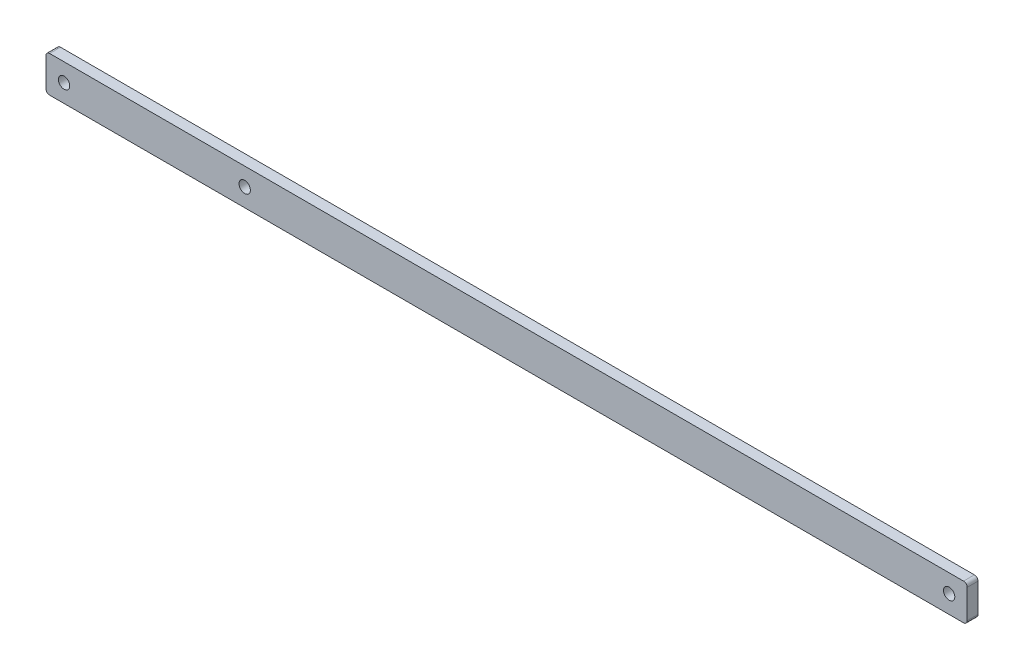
ISO-10303-21;
HEADER;
FILE_DESCRIPTION(('STEP AP214'),'2;1');
FILE_NAME('part.step','',(''),(''),'','','');
FILE_SCHEMA(('AUTOMOTIVE_DESIGN { 1 0 10303 214 1 1 1 1 }'));
ENDSEC;
DATA;
#1=APPLICATION_CONTEXT('core data for automotive mechanical design processes');
#2=APPLICATION_PROTOCOL_DEFINITION('international standard','automotive_design',2000,#1);
#3=PRODUCT_CONTEXT('',#1,'mechanical');
#4=PRODUCT('Part','Part','',(#3));
#5=PRODUCT_RELATED_PRODUCT_CATEGORY('part','',(#4));
#6=PRODUCT_DEFINITION_FORMATION('','',#4);
#7=PRODUCT_DEFINITION_CONTEXT('part definition',#1,'design');
#8=PRODUCT_DEFINITION('design','',#6,#7);
#9=PRODUCT_DEFINITION_SHAPE('','',#8);
#10=(LENGTH_UNIT() NAMED_UNIT(*) SI_UNIT(.MILLI.,.METRE.));
#11=(NAMED_UNIT(*) PLANE_ANGLE_UNIT() SI_UNIT($,.RADIAN.));
#12=(NAMED_UNIT(*) SI_UNIT($,.STERADIAN.) SOLID_ANGLE_UNIT());
#13=UNCERTAINTY_MEASURE_WITH_UNIT(LENGTH_MEASURE(1.E-05),#10,'distance_accuracy_value','');
#14=(GEOMETRIC_REPRESENTATION_CONTEXT(3) GLOBAL_UNCERTAINTY_ASSIGNED_CONTEXT((#13)) GLOBAL_UNIT_ASSIGNED_CONTEXT((#10,
#11,#12)) REPRESENTATION_CONTEXT('',''));
#15=CARTESIAN_POINT('',(0.,0.,0.));
#16=DIRECTION('',(0.,0.,1.));
#17=DIRECTION('',(1.,0.,0.));
#18=AXIS2_PLACEMENT_3D('',#15,#16,#17);
#19=CARTESIAN_POINT('',(0.,0.,7.62));
#20=DIRECTION('',(1.,0.,0.));
#21=DIRECTION('',(0.,0.,-1.));
#22=AXIS2_PLACEMENT_3D('',#19,#20,#21);
#23=PLANE('',#22);
#24=DIRECTION('',(0.,-1.,0.));
#25=VECTOR('',#24,1.);
#26=CARTESIAN_POINT('',(0.,0.,7.62));
#27=LINE('',#26,#25);
#28=CARTESIAN_POINT('',(0.,22.86,7.62));
#29=VERTEX_POINT('',#28);
#30=CARTESIAN_POINT('',(0.,2.54,7.62));
#31=VERTEX_POINT('',#30);
#32=EDGE_CURVE('E129',#29,#31,#27,.T.);
#33=ORIENTED_EDGE('',*,*,#32,.F.);
#34=DIRECTION('',(0.,0.,-1.));
#35=VECTOR('',#34,1.);
#36=CARTESIAN_POINT('',(0.,22.86,7.62));
#37=LINE('',#36,#35);
#38=CARTESIAN_POINT('',(0.,22.86,0.));
#39=VERTEX_POINT('',#38);
#40=EDGE_CURVE('E113',#29,#39,#37,.T.);
#41=ORIENTED_EDGE('',*,*,#40,.T.);
#42=DIRECTION('',(0.,-1.,0.));
#43=VECTOR('',#42,1.);
#44=CARTESIAN_POINT('',(0.,0.,0.));
#45=LINE('',#44,#43);
#46=CARTESIAN_POINT('',(0.,2.54,0.));
#47=VERTEX_POINT('',#46);
#48=EDGE_CURVE('E126',#39,#47,#45,.T.);
#49=ORIENTED_EDGE('',*,*,#48,.T.);
#50=DIRECTION('',(0.,0.,-1.));
#51=VECTOR('',#50,1.);
#52=CARTESIAN_POINT('',(0.,2.54,7.62));
#53=LINE('',#52,#51);
#54=EDGE_CURVE('E132',#47,#31,#53,.F.);
#55=ORIENTED_EDGE('',*,*,#54,.T.);
#56=EDGE_LOOP('',(#33,#41,#49,#55));
#57=FACE_BOUND('',#56,.T.);
#58=ADVANCED_FACE('F42',(#57),#23,.F.);
#59=CARTESIAN_POINT('',(0.,0.,7.62));
#60=DIRECTION('',(0.,1.,0.));
#61=DIRECTION('',(0.,0.,1.));
#62=AXIS2_PLACEMENT_3D('',#59,#60,#61);
#63=PLANE('',#62);
#64=DIRECTION('',(1.,0.,0.));
#65=VECTOR('',#64,1.);
#66=CARTESIAN_POINT('',(0.,0.,7.62));
#67=LINE('',#66,#65);
#68=CARTESIAN_POINT('',(2.54,0.,7.62));
#69=VERTEX_POINT('',#68);
#70=CARTESIAN_POINT('',(645.16,0.,7.62));
#71=VERTEX_POINT('',#70);
#72=EDGE_CURVE('E194',#69,#71,#67,.T.);
#73=ORIENTED_EDGE('',*,*,#72,.F.);
#74=DIRECTION('',(0.,0.,-1.));
#75=VECTOR('',#74,1.);
#76=CARTESIAN_POINT('',(2.54,0.,7.62));
#77=LINE('',#76,#75);
#78=CARTESIAN_POINT('',(2.54,0.,0.));
#79=VERTEX_POINT('',#78);
#80=EDGE_CURVE('E185',#69,#79,#77,.T.);
#81=ORIENTED_EDGE('',*,*,#80,.T.);
#82=DIRECTION('',(1.,0.,0.));
#83=VECTOR('',#82,1.);
#84=CARTESIAN_POINT('',(0.,0.,0.));
#85=LINE('',#84,#83);
#86=CARTESIAN_POINT('',(645.16,0.,0.));
#87=VERTEX_POINT('',#86);
#88=EDGE_CURVE('E137',#79,#87,#85,.T.);
#89=ORIENTED_EDGE('',*,*,#88,.T.);
#90=DIRECTION('',(0.,0.,-1.));
#91=VECTOR('',#90,1.);
#92=CARTESIAN_POINT('',(645.16,0.,7.62));
#93=LINE('',#92,#91);
#94=EDGE_CURVE('E182',#87,#71,#93,.F.);
#95=ORIENTED_EDGE('',*,*,#94,.T.);
#96=EDGE_LOOP('',(#73,#81,#89,#95));
#97=FACE_BOUND('',#96,.T.);
#98=ADVANCED_FACE('F249',(#97),#63,.F.);
#99=CARTESIAN_POINT('',(647.7,0.,7.62));
#100=DIRECTION('',(-1.,0.,0.));
#101=DIRECTION('',(0.,0.,1.));
#102=AXIS2_PLACEMENT_3D('',#99,#100,#101);
#103=PLANE('',#102);
#104=DIRECTION('',(0.,1.,0.));
#105=VECTOR('',#104,1.);
#106=CARTESIAN_POINT('',(647.7,0.,7.62));
#107=LINE('',#106,#105);
#108=CARTESIAN_POINT('',(647.7,2.54,7.62));
#109=VERTEX_POINT('',#108);
#110=CARTESIAN_POINT('',(647.7,22.86,7.62));
#111=VERTEX_POINT('',#110);
#112=EDGE_CURVE('E192',#109,#111,#107,.T.);
#113=ORIENTED_EDGE('',*,*,#112,.F.);
#114=DIRECTION('',(0.,0.,-1.));
#115=VECTOR('',#114,1.);
#116=CARTESIAN_POINT('',(647.7,2.54,7.62));
#117=LINE('',#116,#115);
#118=CARTESIAN_POINT('',(647.7,2.54,0.));
#119=VERTEX_POINT('',#118);
#120=EDGE_CURVE('E11',#109,#119,#117,.T.);
#121=ORIENTED_EDGE('',*,*,#120,.T.);
#122=DIRECTION('',(0.,1.,0.));
#123=VECTOR('',#122,1.);
#124=CARTESIAN_POINT('',(647.7,0.,0.));
#125=LINE('',#124,#123);
#126=CARTESIAN_POINT('',(647.7,22.86,0.));
#127=VERTEX_POINT('',#126);
#128=EDGE_CURVE('E143',#119,#127,#125,.T.);
#129=ORIENTED_EDGE('',*,*,#128,.T.);
#130=DIRECTION('',(0.,0.,-1.));
#131=VECTOR('',#130,1.);
#132=CARTESIAN_POINT('',(647.7,22.86,7.62));
#133=LINE('',#132,#131);
#134=EDGE_CURVE('E51',#127,#111,#133,.F.);
#135=ORIENTED_EDGE('',*,*,#134,.T.);
#136=EDGE_LOOP('',(#113,#121,#129,#135));
#137=FACE_BOUND('',#136,.T.);
#138=ADVANCED_FACE('F242',(#137),#103,.F.);
#139=CARTESIAN_POINT('',(0.,25.4,7.62));
#140=DIRECTION('',(0.,-1.,0.));
#141=DIRECTION('',(0.,0.,-1.));
#142=AXIS2_PLACEMENT_3D('',#139,#140,#141);
#143=PLANE('',#142);
#144=DIRECTION('',(-1.,0.,0.));
#145=VECTOR('',#144,1.);
#146=CARTESIAN_POINT('',(0.,25.4,0.));
#147=LINE('',#146,#145);
#148=CARTESIAN_POINT('',(645.16,25.4,0.));
#149=VERTEX_POINT('',#148);
#150=CARTESIAN_POINT('',(2.54,25.4,0.));
#151=VERTEX_POINT('',#150);
#152=EDGE_CURVE('E154',#149,#151,#147,.T.);
#153=ORIENTED_EDGE('',*,*,#152,.T.);
#154=DIRECTION('',(0.,0.,-1.));
#155=VECTOR('',#154,1.);
#156=CARTESIAN_POINT('',(2.54,25.4,7.62));
#157=LINE('',#156,#155);
#158=CARTESIAN_POINT('',(2.54,25.4,7.62));
#159=VERTEX_POINT('',#158);
#160=EDGE_CURVE('E114',#151,#159,#157,.F.);
#161=ORIENTED_EDGE('',*,*,#160,.T.);
#162=DIRECTION('',(-1.,0.,0.));
#163=VECTOR('',#162,1.);
#164=CARTESIAN_POINT('',(0.,25.4,7.62));
#165=LINE('',#164,#163);
#166=CARTESIAN_POINT('',(645.16,25.4,7.62));
#167=VERTEX_POINT('',#166);
#168=EDGE_CURVE('E149',#167,#159,#165,.T.);
#169=ORIENTED_EDGE('',*,*,#168,.F.);
#170=DIRECTION('',(0.,0.,-1.));
#171=VECTOR('',#170,1.);
#172=CARTESIAN_POINT('',(645.16,25.4,7.62));
#173=LINE('',#172,#171);
#174=EDGE_CURVE('E120',#167,#149,#173,.T.);
#175=ORIENTED_EDGE('',*,*,#174,.T.);
#176=EDGE_LOOP('',(#153,#161,#169,#175));
#177=FACE_BOUND('',#176,.T.);
#178=ADVANCED_FACE('F231',(#177),#143,.F.);
#179=CARTESIAN_POINT('',(0.,0.,7.62));
#180=DIRECTION('',(0.,0.,-1.));
#181=DIRECTION('',(-1.,0.,0.));
#182=AXIS2_PLACEMENT_3D('',#179,#180,#181);
#183=PLANE('',#182);
#184=CARTESIAN_POINT('',(139.7,12.7,7.62));
#185=DIRECTION('',(0.,0.,1.));
#186=DIRECTION('',(1.,0.,0.));
#187=AXIS2_PLACEMENT_3D('',#184,#185,#186);
#188=CIRCLE('',#187,3.99999999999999);
#189=CARTESIAN_POINT('',(143.7,12.7,7.62));
#190=VERTEX_POINT('',#189);
#191=EDGE_CURVE('E212',#190,#190,#188,.T.);
#192=ORIENTED_EDGE('',*,*,#191,.F.);
#193=EDGE_LOOP('',(#192));
#194=FACE_BOUND('',#193,.T.);
#195=CARTESIAN_POINT('',(635.,12.6999999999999,7.62));
#196=DIRECTION('',(0.,0.,-1.));
#197=DIRECTION('',(-1.,0.,0.));
#198=AXIS2_PLACEMENT_3D('',#195,#196,#197);
#199=CIRCLE('',#198,4.);
#200=CARTESIAN_POINT('',(639.,12.6999999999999,7.62));
#201=VERTEX_POINT('',#200);
#202=EDGE_CURVE('E204',#201,#201,#199,.T.);
#203=ORIENTED_EDGE('',*,*,#202,.T.);
#204=EDGE_LOOP('',(#203));
#205=FACE_BOUND('',#204,.T.);
#206=CARTESIAN_POINT('',(12.7,12.6999999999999,7.62));
#207=DIRECTION('',(0.,0.,1.));
#208=DIRECTION('',(1.,0.,0.));
#209=AXIS2_PLACEMENT_3D('',#206,#207,#208);
#210=CIRCLE('',#209,4.);
#211=CARTESIAN_POINT('',(16.7,12.6999999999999,7.62));
#212=VERTEX_POINT('',#211);
#213=EDGE_CURVE('E146',#212,#212,#210,.T.);
#214=ORIENTED_EDGE('',*,*,#213,.F.);
#215=EDGE_LOOP('',(#214));
#216=FACE_BOUND('',#215,.T.);
#217=ORIENTED_EDGE('',*,*,#168,.T.);
#218=CARTESIAN_POINT('',(2.54,22.86,7.62));
#219=DIRECTION('',(0.,0.,-1.));
#220=DIRECTION('',(-1.,0.,0.));
#221=AXIS2_PLACEMENT_3D('',#218,#219,#220);
#222=CIRCLE('',#221,2.54);
#223=EDGE_CURVE('E179',#159,#29,#222,.F.);
#224=ORIENTED_EDGE('',*,*,#223,.T.);
#225=ORIENTED_EDGE('',*,*,#32,.T.);
#226=CARTESIAN_POINT('',(2.54,2.54,7.62));
#227=DIRECTION('',(0.,0.,-1.));
#228=DIRECTION('',(-1.,0.,0.));
#229=AXIS2_PLACEMENT_3D('',#226,#227,#228);
#230=CIRCLE('',#229,2.54);
#231=EDGE_CURVE('E176',#31,#69,#230,.F.);
#232=ORIENTED_EDGE('',*,*,#231,.T.);
#233=ORIENTED_EDGE('',*,*,#72,.T.);
#234=CARTESIAN_POINT('',(645.16,2.54,7.62));
#235=DIRECTION('',(0.,0.,-1.));
#236=DIRECTION('',(-1.,0.,0.));
#237=AXIS2_PLACEMENT_3D('',#234,#235,#236);
#238=CIRCLE('',#237,2.54);
#239=EDGE_CURVE('E64',#71,#109,#238,.F.);
#240=ORIENTED_EDGE('',*,*,#239,.T.);
#241=ORIENTED_EDGE('',*,*,#112,.T.);
#242=CARTESIAN_POINT('',(645.16,22.86,7.62));
#243=DIRECTION('',(0.,0.,-1.));
#244=DIRECTION('',(-1.,0.,0.));
#245=AXIS2_PLACEMENT_3D('',#242,#243,#244);
#246=CIRCLE('',#245,2.54);
#247=EDGE_CURVE('E171',#111,#167,#246,.F.);
#248=ORIENTED_EDGE('',*,*,#247,.T.);
#249=EDGE_LOOP('',(#217,#224,#225,#232,#233,#240,#241,#248));
#250=FACE_BOUND('',#249,.T.);
#251=ADVANCED_FACE('F228',(#194,#205,#216,#250),#183,.F.);
#252=CARTESIAN_POINT('',(0.,0.,0.));
#253=DIRECTION('',(0.,0.,-1.));
#254=DIRECTION('',(-1.,0.,0.));
#255=AXIS2_PLACEMENT_3D('',#252,#253,#254);
#256=PLANE('',#255);
#257=CARTESIAN_POINT('',(139.7,12.7,0.));
#258=DIRECTION('',(0.,0.,1.));
#259=DIRECTION('',(1.,0.,0.));
#260=AXIS2_PLACEMENT_3D('',#257,#258,#259);
#261=CIRCLE('',#260,3.99999999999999);
#262=CARTESIAN_POINT('',(143.7,12.7,0.));
#263=VERTEX_POINT('',#262);
#264=EDGE_CURVE('E208',#263,#263,#261,.T.);
#265=ORIENTED_EDGE('',*,*,#264,.T.);
#266=EDGE_LOOP('',(#265));
#267=FACE_BOUND('',#266,.T.);
#268=CARTESIAN_POINT('',(635.,12.6999999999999,0.));
#269=DIRECTION('',(0.,0.,-1.));
#270=DIRECTION('',(-1.,0.,0.));
#271=AXIS2_PLACEMENT_3D('',#268,#269,#270);
#272=CIRCLE('',#271,4.);
#273=CARTESIAN_POINT('',(639.,12.6999999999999,0.));
#274=VERTEX_POINT('',#273);
#275=EDGE_CURVE('E202',#274,#274,#272,.T.);
#276=ORIENTED_EDGE('',*,*,#275,.F.);
#277=EDGE_LOOP('',(#276));
#278=FACE_BOUND('',#277,.T.);
#279=CARTESIAN_POINT('',(12.7,12.6999999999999,0.));
#280=DIRECTION('',(0.,0.,1.));
#281=DIRECTION('',(1.,0.,0.));
#282=AXIS2_PLACEMENT_3D('',#279,#280,#281);
#283=CIRCLE('',#282,4.);
#284=CARTESIAN_POINT('',(16.7,12.6999999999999,0.));
#285=VERTEX_POINT('',#284);
#286=EDGE_CURVE('E138',#285,#285,#283,.T.);
#287=ORIENTED_EDGE('',*,*,#286,.T.);
#288=EDGE_LOOP('',(#287));
#289=FACE_BOUND('',#288,.T.);
#290=ORIENTED_EDGE('',*,*,#48,.F.);
#291=CARTESIAN_POINT('',(2.54,22.86,0.));
#292=DIRECTION('',(0.,0.,-1.));
#293=DIRECTION('',(-1.,0.,0.));
#294=AXIS2_PLACEMENT_3D('',#291,#292,#293);
#295=CIRCLE('',#294,2.54);
#296=EDGE_CURVE('E109',#39,#151,#295,.T.);
#297=ORIENTED_EDGE('',*,*,#296,.T.);
#298=ORIENTED_EDGE('',*,*,#152,.F.);
#299=CARTESIAN_POINT('',(645.16,22.86,0.));
#300=DIRECTION('',(0.,0.,-1.));
#301=DIRECTION('',(-1.,0.,0.));
#302=AXIS2_PLACEMENT_3D('',#299,#300,#301);
#303=CIRCLE('',#302,2.54);
#304=EDGE_CURVE('E131',#149,#127,#303,.T.);
#305=ORIENTED_EDGE('',*,*,#304,.T.);
#306=ORIENTED_EDGE('',*,*,#128,.F.);
#307=CARTESIAN_POINT('',(645.16,2.54,0.));
#308=DIRECTION('',(0.,0.,-1.));
#309=DIRECTION('',(-1.,0.,0.));
#310=AXIS2_PLACEMENT_3D('',#307,#308,#309);
#311=CIRCLE('',#310,2.54);
#312=EDGE_CURVE('E161',#119,#87,#311,.T.);
#313=ORIENTED_EDGE('',*,*,#312,.T.);
#314=ORIENTED_EDGE('',*,*,#88,.F.);
#315=CARTESIAN_POINT('',(2.54,2.54,0.));
#316=DIRECTION('',(0.,0.,-1.));
#317=DIRECTION('',(-1.,0.,0.));
#318=AXIS2_PLACEMENT_3D('',#315,#316,#317);
#319=CIRCLE('',#318,2.54);
#320=EDGE_CURVE('E121',#79,#47,#319,.T.);
#321=ORIENTED_EDGE('',*,*,#320,.T.);
#322=EDGE_LOOP('',(#290,#297,#298,#305,#306,#313,#314,#321));
#323=FACE_BOUND('',#322,.T.);
#324=ADVANCED_FACE('F134',(#267,#278,#289,#323),#256,.T.);
#325=CARTESIAN_POINT('',(12.7,12.6999999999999,0.));
#326=DIRECTION('',(0.,0.,1.));
#327=DIRECTION('',(1.,0.,0.));
#328=AXIS2_PLACEMENT_3D('',#325,#326,#327);
#329=CYLINDRICAL_SURFACE('',#328,4.);
#330=CARTESIAN_POINT('',(16.7,12.6999999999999,0.));
#331=CARTESIAN_POINT('',(16.7,12.6999999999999,0.0793749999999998));
#332=CARTESIAN_POINT('',(16.7,12.6999999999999,0.15875));
#333=CARTESIAN_POINT('',(16.7,12.6999999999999,0.3175));
#334=CARTESIAN_POINT('',(16.7,12.6999999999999,0.396875));
#335=CARTESIAN_POINT('',(16.7,12.6999999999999,0.555625));
#336=CARTESIAN_POINT('',(16.7,12.6999999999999,0.635));
#337=CARTESIAN_POINT('',(16.7,12.6999999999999,0.79375));
#338=CARTESIAN_POINT('',(16.7,12.6999999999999,0.873125));
#339=CARTESIAN_POINT('',(16.7,12.6999999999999,1.031875));
#340=CARTESIAN_POINT('',(16.7,12.6999999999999,1.11125));
#341=CARTESIAN_POINT('',(16.7,12.6999999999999,1.27));
#342=CARTESIAN_POINT('',(16.7,12.6999999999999,1.349375));
#343=CARTESIAN_POINT('',(16.7,12.6999999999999,1.508125));
#344=CARTESIAN_POINT('',(16.7,12.6999999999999,1.5875));
#345=CARTESIAN_POINT('',(16.7,12.6999999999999,1.74625));
#346=CARTESIAN_POINT('',(16.7,12.6999999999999,1.825625));
#347=CARTESIAN_POINT('',(16.7,12.6999999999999,1.984375));
#348=CARTESIAN_POINT('',(16.7,12.6999999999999,2.06375));
#349=CARTESIAN_POINT('',(16.7,12.6999999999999,2.2225));
#350=CARTESIAN_POINT('',(16.7,12.6999999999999,2.301875));
#351=CARTESIAN_POINT('',(16.7,12.6999999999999,2.460625));
#352=CARTESIAN_POINT('',(16.7,12.6999999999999,2.54));
#353=CARTESIAN_POINT('',(16.7,12.6999999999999,2.69875));
#354=CARTESIAN_POINT('',(16.7,12.6999999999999,2.778125));
#355=CARTESIAN_POINT('',(16.7,12.6999999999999,2.936875));
#356=CARTESIAN_POINT('',(16.7,12.6999999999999,3.01625));
#357=CARTESIAN_POINT('',(16.7,12.6999999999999,3.175));
#358=CARTESIAN_POINT('',(16.7,12.6999999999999,3.254375));
#359=CARTESIAN_POINT('',(16.7,12.6999999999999,3.413125));
#360=CARTESIAN_POINT('',(16.7,12.6999999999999,3.4925));
#361=CARTESIAN_POINT('',(16.7,12.6999999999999,3.65125));
#362=CARTESIAN_POINT('',(16.7,12.6999999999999,3.730625));
#363=CARTESIAN_POINT('',(16.7,12.6999999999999,3.889375));
#364=CARTESIAN_POINT('',(16.7,12.6999999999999,3.96875));
#365=CARTESIAN_POINT('',(16.7,12.6999999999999,4.1275));
#366=CARTESIAN_POINT('',(16.7,12.6999999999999,4.206875));
#367=CARTESIAN_POINT('',(16.7,12.6999999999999,4.365625));
#368=CARTESIAN_POINT('',(16.7,12.6999999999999,4.445));
#369=CARTESIAN_POINT('',(16.7,12.6999999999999,4.60375));
#370=CARTESIAN_POINT('',(16.7,12.6999999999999,4.683125));
#371=CARTESIAN_POINT('',(16.7,12.6999999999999,4.841875));
#372=CARTESIAN_POINT('',(16.7,12.6999999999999,4.92125));
#373=CARTESIAN_POINT('',(16.7,12.6999999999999,5.08));
#374=CARTESIAN_POINT('',(16.7,12.6999999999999,5.159375));
#375=CARTESIAN_POINT('',(16.7,12.6999999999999,5.318125));
#376=CARTESIAN_POINT('',(16.7,12.6999999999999,5.3975));
#377=CARTESIAN_POINT('',(16.7,12.6999999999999,5.55625));
#378=CARTESIAN_POINT('',(16.7,12.6999999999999,5.635625));
#379=CARTESIAN_POINT('',(16.7,12.6999999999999,5.794375));
#380=CARTESIAN_POINT('',(16.7,12.6999999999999,5.87375));
#381=CARTESIAN_POINT('',(16.7,12.6999999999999,6.0325));
#382=CARTESIAN_POINT('',(16.7,12.6999999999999,6.111875));
#383=CARTESIAN_POINT('',(16.7,12.6999999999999,6.270625));
#384=CARTESIAN_POINT('',(16.7,12.6999999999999,6.35));
#385=CARTESIAN_POINT('',(16.7,12.6999999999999,6.50875));
#386=CARTESIAN_POINT('',(16.7,12.6999999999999,6.588125));
#387=CARTESIAN_POINT('',(16.7,12.6999999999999,6.746875));
#388=CARTESIAN_POINT('',(16.7,12.6999999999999,6.82625));
#389=CARTESIAN_POINT('',(16.7,12.6999999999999,6.985));
#390=CARTESIAN_POINT('',(16.7,12.6999999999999,7.064375));
#391=CARTESIAN_POINT('',(16.7,12.6999999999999,7.223125));
#392=CARTESIAN_POINT('',(16.7,12.6999999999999,7.3025));
#393=CARTESIAN_POINT('',(16.7,12.6999999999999,7.46125));
#394=CARTESIAN_POINT('',(16.7,12.6999999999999,7.540625));
#395=CARTESIAN_POINT('',(16.7,12.6999999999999,7.62));
#396=B_SPLINE_CURVE_WITH_KNOTS('',3,(#330,#331,#332,#333,#334,#335,#336,#337,#338,#339,#340,
#341,#342,#343,#344,#345,#346,#347,#348,#349,#350,#351,#352,#353,#354,#355,#356,#357,#358,#359,
#360,#361,#362,#363,#364,#365,#366,#367,#368,#369,#370,#371,#372,#373,#374,#375,#376,#377,#378,
#379,#380,#381,#382,#383,#384,#385,#386,#387,#388,#389,#390,#391,#392,#393,#394,#395),
.UNSPECIFIED.,.F.,.F.,(4,2,2,2,2,2,2,2,2,2,2,2,2,2,2,2,2,2,2,2,2,2,2,2,2,2,2,2,2,2,2,2,4),(0.,
0.238125,0.47625,0.714375,0.9525,1.190625,1.42875,1.666875,1.905,2.143125,2.38125,2.619375,
2.8575,3.095625,3.33375,3.571875,3.81,4.048125,4.28625,4.524375,4.7625,5.000625,5.23875,
5.476875,5.715,5.953125,6.19125,6.429375,6.6675,6.905625,7.14375,7.381875,7.62),.UNSPECIFIED.);
#397=EDGE_CURVE('BSEAM273',#285,#212,#396,.T.);
#398=ORIENTED_EDGE('',*,*,#286,.F.);
#399=ORIENTED_EDGE('',*,*,#213,.T.);
#400=ORIENTED_EDGE('',*,*,#397,.T.);
#401=ORIENTED_EDGE('',*,*,#397,.F.);
#402=EDGE_LOOP('',(#398,#400,#399,#401));
#403=FACE_BOUND('',#402,.T.);
#404=ADVANCED_FACE('F273',(#403),#329,.F.);
#405=CARTESIAN_POINT('',(635.,12.6999999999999,0.));
#406=DIRECTION('',(0.,0.,1.));
#407=DIRECTION('',(1.,0.,0.));
#408=AXIS2_PLACEMENT_3D('',#405,#406,#407);
#409=CYLINDRICAL_SURFACE('',#408,4.);
#410=CARTESIAN_POINT('',(639.,12.6999999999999,0.));
#411=CARTESIAN_POINT('',(639.,12.6999999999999,0.0793749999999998));
#412=CARTESIAN_POINT('',(639.,12.6999999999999,0.15875));
#413=CARTESIAN_POINT('',(639.,12.6999999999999,0.3175));
#414=CARTESIAN_POINT('',(639.,12.6999999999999,0.396875));
#415=CARTESIAN_POINT('',(639.,12.6999999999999,0.555625));
#416=CARTESIAN_POINT('',(639.,12.6999999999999,0.635));
#417=CARTESIAN_POINT('',(639.,12.6999999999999,0.79375));
#418=CARTESIAN_POINT('',(639.,12.6999999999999,0.873125));
#419=CARTESIAN_POINT('',(639.,12.6999999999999,1.031875));
#420=CARTESIAN_POINT('',(639.,12.6999999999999,1.11125));
#421=CARTESIAN_POINT('',(639.,12.6999999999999,1.27));
#422=CARTESIAN_POINT('',(639.,12.6999999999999,1.349375));
#423=CARTESIAN_POINT('',(639.,12.6999999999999,1.508125));
#424=CARTESIAN_POINT('',(639.,12.6999999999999,1.5875));
#425=CARTESIAN_POINT('',(639.,12.6999999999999,1.74625));
#426=CARTESIAN_POINT('',(639.,12.6999999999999,1.825625));
#427=CARTESIAN_POINT('',(639.,12.6999999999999,1.984375));
#428=CARTESIAN_POINT('',(639.,12.6999999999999,2.06375));
#429=CARTESIAN_POINT('',(639.,12.6999999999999,2.2225));
#430=CARTESIAN_POINT('',(639.,12.6999999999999,2.301875));
#431=CARTESIAN_POINT('',(639.,12.6999999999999,2.460625));
#432=CARTESIAN_POINT('',(639.,12.6999999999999,2.54));
#433=CARTESIAN_POINT('',(639.,12.6999999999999,2.69875));
#434=CARTESIAN_POINT('',(639.,12.6999999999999,2.778125));
#435=CARTESIAN_POINT('',(639.,12.6999999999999,2.936875));
#436=CARTESIAN_POINT('',(639.,12.6999999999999,3.01625));
#437=CARTESIAN_POINT('',(639.,12.6999999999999,3.175));
#438=CARTESIAN_POINT('',(639.,12.6999999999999,3.254375));
#439=CARTESIAN_POINT('',(639.,12.6999999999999,3.413125));
#440=CARTESIAN_POINT('',(639.,12.6999999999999,3.4925));
#441=CARTESIAN_POINT('',(639.,12.6999999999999,3.65125));
#442=CARTESIAN_POINT('',(639.,12.6999999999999,3.730625));
#443=CARTESIAN_POINT('',(639.,12.6999999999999,3.889375));
#444=CARTESIAN_POINT('',(639.,12.6999999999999,3.96875));
#445=CARTESIAN_POINT('',(639.,12.6999999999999,4.1275));
#446=CARTESIAN_POINT('',(639.,12.6999999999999,4.206875));
#447=CARTESIAN_POINT('',(639.,12.6999999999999,4.365625));
#448=CARTESIAN_POINT('',(639.,12.6999999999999,4.445));
#449=CARTESIAN_POINT('',(639.,12.6999999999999,4.60375));
#450=CARTESIAN_POINT('',(639.,12.6999999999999,4.683125));
#451=CARTESIAN_POINT('',(639.,12.6999999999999,4.841875));
#452=CARTESIAN_POINT('',(639.,12.6999999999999,4.92125));
#453=CARTESIAN_POINT('',(639.,12.6999999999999,5.08));
#454=CARTESIAN_POINT('',(639.,12.6999999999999,5.159375));
#455=CARTESIAN_POINT('',(639.,12.6999999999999,5.318125));
#456=CARTESIAN_POINT('',(639.,12.6999999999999,5.3975));
#457=CARTESIAN_POINT('',(639.,12.6999999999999,5.55625));
#458=CARTESIAN_POINT('',(639.,12.6999999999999,5.635625));
#459=CARTESIAN_POINT('',(639.,12.6999999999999,5.794375));
#460=CARTESIAN_POINT('',(639.,12.6999999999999,5.87375));
#461=CARTESIAN_POINT('',(639.,12.6999999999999,6.0325));
#462=CARTESIAN_POINT('',(639.,12.6999999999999,6.111875));
#463=CARTESIAN_POINT('',(639.,12.6999999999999,6.270625));
#464=CARTESIAN_POINT('',(639.,12.6999999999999,6.35));
#465=CARTESIAN_POINT('',(639.,12.6999999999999,6.50875));
#466=CARTESIAN_POINT('',(639.,12.6999999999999,6.588125));
#467=CARTESIAN_POINT('',(639.,12.6999999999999,6.746875));
#468=CARTESIAN_POINT('',(639.,12.6999999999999,6.82625));
#469=CARTESIAN_POINT('',(639.,12.6999999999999,6.985));
#470=CARTESIAN_POINT('',(639.,12.6999999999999,7.064375));
#471=CARTESIAN_POINT('',(639.,12.6999999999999,7.223125));
#472=CARTESIAN_POINT('',(639.,12.6999999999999,7.3025));
#473=CARTESIAN_POINT('',(639.,12.6999999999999,7.46125));
#474=CARTESIAN_POINT('',(639.,12.6999999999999,7.540625));
#475=CARTESIAN_POINT('',(639.,12.6999999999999,7.62));
#476=B_SPLINE_CURVE_WITH_KNOTS('',3,(#410,#411,#412,#413,#414,#415,#416,#417,#418,#419,#420,
#421,#422,#423,#424,#425,#426,#427,#428,#429,#430,#431,#432,#433,#434,#435,#436,#437,#438,#439,
#440,#441,#442,#443,#444,#445,#446,#447,#448,#449,#450,#451,#452,#453,#454,#455,#456,#457,#458,
#459,#460,#461,#462,#463,#464,#465,#466,#467,#468,#469,#470,#471,#472,#473,#474,#475),
.UNSPECIFIED.,.F.,.F.,(4,2,2,2,2,2,2,2,2,2,2,2,2,2,2,2,2,2,2,2,2,2,2,2,2,2,2,2,2,2,2,2,4),(0.,
0.238125,0.47625,0.714375,0.9525,1.190625,1.42875,1.666875,1.905,2.143125,2.38125,2.619375,
2.8575,3.095625,3.33375,3.571875,3.81,4.048125,4.28625,4.524375,4.7625,5.000625,5.23875,
5.476875,5.715,5.953125,6.19125,6.429375,6.6675,6.905625,7.14375,7.381875,7.62),.UNSPECIFIED.);
#477=EDGE_CURVE('BSEAM259',#274,#201,#476,.T.);
#478=ORIENTED_EDGE('',*,*,#275,.T.);
#479=ORIENTED_EDGE('',*,*,#202,.F.);
#480=ORIENTED_EDGE('',*,*,#477,.T.);
#481=ORIENTED_EDGE('',*,*,#477,.F.);
#482=EDGE_LOOP('',(#478,#480,#479,#481));
#483=FACE_BOUND('',#482,.T.);
#484=ADVANCED_FACE('F259',(#483),#409,.F.);
#485=CARTESIAN_POINT('',(2.54,22.86,7.62));
#486=DIRECTION('',(0.,0.,-1.));
#487=DIRECTION('',(-1.,0.,0.));
#488=AXIS2_PLACEMENT_3D('',#485,#486,#487);
#489=CYLINDRICAL_SURFACE('',#488,2.54);
#490=ORIENTED_EDGE('',*,*,#223,.F.);
#491=ORIENTED_EDGE('',*,*,#160,.F.);
#492=ORIENTED_EDGE('',*,*,#296,.F.);
#493=ORIENTED_EDGE('',*,*,#40,.F.);
#494=EDGE_LOOP('',(#490,#491,#492,#493));
#495=FACE_BOUND('',#494,.T.);
#496=ADVANCED_FACE('F112',(#495),#489,.T.);
#497=CARTESIAN_POINT('',(2.54,2.54,7.62));
#498=DIRECTION('',(0.,0.,-1.));
#499=DIRECTION('',(-1.,0.,0.));
#500=AXIS2_PLACEMENT_3D('',#497,#498,#499);
#501=CYLINDRICAL_SURFACE('',#500,2.54);
#502=ORIENTED_EDGE('',*,*,#231,.F.);
#503=ORIENTED_EDGE('',*,*,#54,.F.);
#504=ORIENTED_EDGE('',*,*,#320,.F.);
#505=ORIENTED_EDGE('',*,*,#80,.F.);
#506=EDGE_LOOP('',(#502,#503,#504,#505));
#507=FACE_BOUND('',#506,.T.);
#508=ADVANCED_FACE('F252',(#507),#501,.T.);
#509=CARTESIAN_POINT('',(645.16,2.54,7.62));
#510=DIRECTION('',(0.,0.,-1.));
#511=DIRECTION('',(-1.,0.,0.));
#512=AXIS2_PLACEMENT_3D('',#509,#510,#511);
#513=CYLINDRICAL_SURFACE('',#512,2.54);
#514=ORIENTED_EDGE('',*,*,#239,.F.);
#515=ORIENTED_EDGE('',*,*,#94,.F.);
#516=ORIENTED_EDGE('',*,*,#312,.F.);
#517=ORIENTED_EDGE('',*,*,#120,.F.);
#518=EDGE_LOOP('',(#514,#515,#516,#517));
#519=FACE_BOUND('',#518,.T.);
#520=ADVANCED_FACE('F245',(#519),#513,.T.);
#521=CARTESIAN_POINT('',(645.16,22.86,7.62));
#522=DIRECTION('',(0.,0.,-1.));
#523=DIRECTION('',(-1.,0.,0.));
#524=AXIS2_PLACEMENT_3D('',#521,#522,#523);
#525=CYLINDRICAL_SURFACE('',#524,2.54);
#526=ORIENTED_EDGE('',*,*,#247,.F.);
#527=ORIENTED_EDGE('',*,*,#134,.F.);
#528=ORIENTED_EDGE('',*,*,#304,.F.);
#529=ORIENTED_EDGE('',*,*,#174,.F.);
#530=EDGE_LOOP('',(#526,#527,#528,#529));
#531=FACE_BOUND('',#530,.T.);
#532=ADVANCED_FACE('F44',(#531),#525,.T.);
#533=CARTESIAN_POINT('',(139.7,12.7,0.));
#534=DIRECTION('',(0.,0.,1.));
#535=DIRECTION('',(1.,0.,0.));
#536=AXIS2_PLACEMENT_3D('',#533,#534,#535);
#537=CYLINDRICAL_SURFACE('',#536,3.99999999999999);
#538=CARTESIAN_POINT('',(143.7,12.7,0.));
#539=CARTESIAN_POINT('',(143.7,12.7,0.0793749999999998));
#540=CARTESIAN_POINT('',(143.7,12.7,0.15875));
#541=CARTESIAN_POINT('',(143.7,12.7,0.3175));
#542=CARTESIAN_POINT('',(143.7,12.7,0.396875));
#543=CARTESIAN_POINT('',(143.7,12.7,0.555625));
#544=CARTESIAN_POINT('',(143.7,12.7,0.635));
#545=CARTESIAN_POINT('',(143.7,12.7,0.79375));
#546=CARTESIAN_POINT('',(143.7,12.7,0.873125));
#547=CARTESIAN_POINT('',(143.7,12.7,1.031875));
#548=CARTESIAN_POINT('',(143.7,12.7,1.11125));
#549=CARTESIAN_POINT('',(143.7,12.7,1.27));
#550=CARTESIAN_POINT('',(143.7,12.7,1.349375));
#551=CARTESIAN_POINT('',(143.7,12.7,1.508125));
#552=CARTESIAN_POINT('',(143.7,12.7,1.5875));
#553=CARTESIAN_POINT('',(143.7,12.7,1.74625));
#554=CARTESIAN_POINT('',(143.7,12.7,1.825625));
#555=CARTESIAN_POINT('',(143.7,12.7,1.984375));
#556=CARTESIAN_POINT('',(143.7,12.7,2.06375));
#557=CARTESIAN_POINT('',(143.7,12.7,2.2225));
#558=CARTESIAN_POINT('',(143.7,12.7,2.301875));
#559=CARTESIAN_POINT('',(143.7,12.7,2.460625));
#560=CARTESIAN_POINT('',(143.7,12.7,2.54));
#561=CARTESIAN_POINT('',(143.7,12.7,2.69875));
#562=CARTESIAN_POINT('',(143.7,12.7,2.778125));
#563=CARTESIAN_POINT('',(143.7,12.7,2.936875));
#564=CARTESIAN_POINT('',(143.7,12.7,3.01625));
#565=CARTESIAN_POINT('',(143.7,12.7,3.175));
#566=CARTESIAN_POINT('',(143.7,12.7,3.254375));
#567=CARTESIAN_POINT('',(143.7,12.7,3.413125));
#568=CARTESIAN_POINT('',(143.7,12.7,3.4925));
#569=CARTESIAN_POINT('',(143.7,12.7,3.65125));
#570=CARTESIAN_POINT('',(143.7,12.7,3.730625));
#571=CARTESIAN_POINT('',(143.7,12.7,3.889375));
#572=CARTESIAN_POINT('',(143.7,12.7,3.96875));
#573=CARTESIAN_POINT('',(143.7,12.7,4.1275));
#574=CARTESIAN_POINT('',(143.7,12.7,4.206875));
#575=CARTESIAN_POINT('',(143.7,12.7,4.365625));
#576=CARTESIAN_POINT('',(143.7,12.7,4.445));
#577=CARTESIAN_POINT('',(143.7,12.7,4.60375));
#578=CARTESIAN_POINT('',(143.7,12.7,4.683125));
#579=CARTESIAN_POINT('',(143.7,12.7,4.841875));
#580=CARTESIAN_POINT('',(143.7,12.7,4.92125));
#581=CARTESIAN_POINT('',(143.7,12.7,5.08));
#582=CARTESIAN_POINT('',(143.7,12.7,5.159375));
#583=CARTESIAN_POINT('',(143.7,12.7,5.318125));
#584=CARTESIAN_POINT('',(143.7,12.7,5.3975));
#585=CARTESIAN_POINT('',(143.7,12.7,5.55625));
#586=CARTESIAN_POINT('',(143.7,12.7,5.635625));
#587=CARTESIAN_POINT('',(143.7,12.7,5.794375));
#588=CARTESIAN_POINT('',(143.7,12.7,5.87375));
#589=CARTESIAN_POINT('',(143.7,12.7,6.0325));
#590=CARTESIAN_POINT('',(143.7,12.7,6.111875));
#591=CARTESIAN_POINT('',(143.7,12.7,6.270625));
#592=CARTESIAN_POINT('',(143.7,12.7,6.35));
#593=CARTESIAN_POINT('',(143.7,12.7,6.50875));
#594=CARTESIAN_POINT('',(143.7,12.7,6.588125));
#595=CARTESIAN_POINT('',(143.7,12.7,6.746875));
#596=CARTESIAN_POINT('',(143.7,12.7,6.82625));
#597=CARTESIAN_POINT('',(143.7,12.7,6.985));
#598=CARTESIAN_POINT('',(143.7,12.7,7.064375));
#599=CARTESIAN_POINT('',(143.7,12.7,7.223125));
#600=CARTESIAN_POINT('',(143.7,12.7,7.3025));
#601=CARTESIAN_POINT('',(143.7,12.7,7.46125));
#602=CARTESIAN_POINT('',(143.7,12.7,7.540625));
#603=CARTESIAN_POINT('',(143.7,12.7,7.62));
#604=B_SPLINE_CURVE_WITH_KNOTS('',3,(#538,#539,#540,#541,#542,#543,#544,#545,#546,#547,#548,
#549,#550,#551,#552,#553,#554,#555,#556,#557,#558,#559,#560,#561,#562,#563,#564,#565,#566,#567,
#568,#569,#570,#571,#572,#573,#574,#575,#576,#577,#578,#579,#580,#581,#582,#583,#584,#585,#586,
#587,#588,#589,#590,#591,#592,#593,#594,#595,#596,#597,#598,#599,#600,#601,#602,#603),
.UNSPECIFIED.,.F.,.F.,(4,2,2,2,2,2,2,2,2,2,2,2,2,2,2,2,2,2,2,2,2,2,2,2,2,2,2,2,2,2,2,2,4),(0.,
0.238125,0.47625,0.714375,0.9525,1.190625,1.42875,1.666875,1.905,2.143125,2.38125,2.619375,
2.8575,3.095625,3.33375,3.571875,3.81,4.048125,4.28625,4.524375,4.7625,5.000625,5.23875,
5.476875,5.715,5.953125,6.19125,6.429375,6.6675,6.905625,7.14375,7.381875,7.62),.UNSPECIFIED.);
#605=EDGE_CURVE('BSEAM222',#263,#190,#604,.T.);
#606=ORIENTED_EDGE('',*,*,#264,.F.);
#607=ORIENTED_EDGE('',*,*,#191,.T.);
#608=ORIENTED_EDGE('',*,*,#605,.T.);
#609=ORIENTED_EDGE('',*,*,#605,.F.);
#610=EDGE_LOOP('',(#606,#608,#607,#609));
#611=FACE_BOUND('',#610,.T.);
#612=ADVANCED_FACE('F222',(#611),#537,.F.);
#613=CLOSED_SHELL('',(#58,#98,#138,#178,#251,#324,#404,#484,#496,#508,#520,#532,#612));
#614=MANIFOLD_SOLID_BREP('B2',#613);
#615=ADVANCED_BREP_SHAPE_REPRESENTATION('',(#18,#614),#14);
#616=SHAPE_DEFINITION_REPRESENTATION(#9,#615);
ENDSEC;
END-ISO-10303-21;
